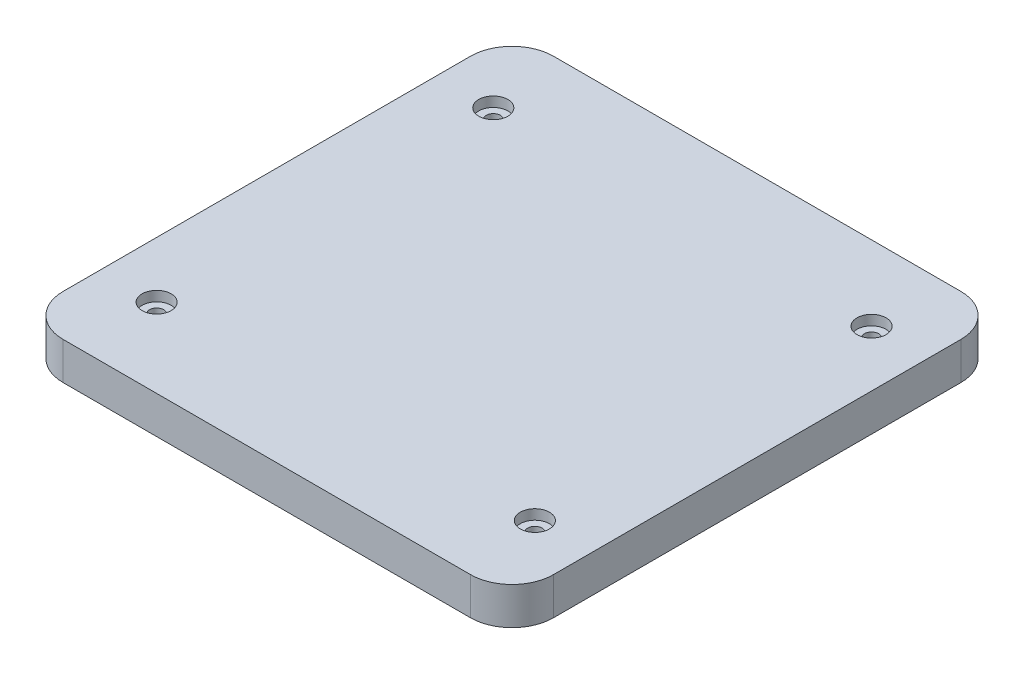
ISO-10303-21;
HEADER;
FILE_DESCRIPTION(('STEP AP214'),'2;1');
FILE_NAME('part.step','',(''),(''),'','','');
FILE_SCHEMA(('AUTOMOTIVE_DESIGN { 1 0 10303 214 1 1 1 1 }'));
ENDSEC;
DATA;
#1=APPLICATION_CONTEXT('core data for automotive mechanical design processes');
#2=APPLICATION_PROTOCOL_DEFINITION('international standard','automotive_design',2000,#1);
#3=PRODUCT_CONTEXT('',#1,'mechanical');
#4=PRODUCT('Part','Part','',(#3));
#5=PRODUCT_RELATED_PRODUCT_CATEGORY('part','',(#4));
#6=PRODUCT_DEFINITION_FORMATION('','',#4);
#7=PRODUCT_DEFINITION_CONTEXT('part definition',#1,'design');
#8=PRODUCT_DEFINITION('design','',#6,#7);
#9=PRODUCT_DEFINITION_SHAPE('','',#8);
#10=(LENGTH_UNIT() NAMED_UNIT(*) SI_UNIT(.MILLI.,.METRE.));
#11=(NAMED_UNIT(*) PLANE_ANGLE_UNIT() SI_UNIT($,.RADIAN.));
#12=(NAMED_UNIT(*) SI_UNIT($,.STERADIAN.) SOLID_ANGLE_UNIT());
#13=UNCERTAINTY_MEASURE_WITH_UNIT(LENGTH_MEASURE(1.E-05),#10,'distance_accuracy_value','');
#14=(GEOMETRIC_REPRESENTATION_CONTEXT(3) GLOBAL_UNCERTAINTY_ASSIGNED_CONTEXT((#13)) GLOBAL_UNIT_ASSIGNED_CONTEXT((#10,
#11,#12)) REPRESENTATION_CONTEXT('',''));
#15=CARTESIAN_POINT('',(0.,0.,0.));
#16=DIRECTION('',(0.,0.,1.));
#17=DIRECTION('',(1.,0.,0.));
#18=AXIS2_PLACEMENT_3D('',#15,#16,#17);
#19=CARTESIAN_POINT('',(-25.9999999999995,339.,159.));
#20=DIRECTION('',(-1.,0.,0.));
#21=DIRECTION('',(0.,0.,1.));
#22=AXIS2_PLACEMENT_3D('',#19,#20,#21);
#23=PLANE('',#22);
#24=DIRECTION('',(0.,0.,-1.));
#25=VECTOR('',#24,1.);
#26=CARTESIAN_POINT('',(-25.9999999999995,330.,159.));
#27=LINE('',#26,#25);
#28=CARTESIAN_POINT('',(-25.9999999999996,330.,149.));
#29=VERTEX_POINT('',#28);
#30=CARTESIAN_POINT('',(-26.0000000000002,330.,50.9999999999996));
#31=VERTEX_POINT('',#30);
#32=EDGE_CURVE('E132',#29,#31,#27,.T.);
#33=ORIENTED_EDGE('',*,*,#32,.T.);
#34=DIRECTION('',(0.,-1.,0.));
#35=VECTOR('',#34,1.);
#36=CARTESIAN_POINT('',(-26.0000000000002,339.,50.9999999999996));
#37=LINE('',#36,#35);
#38=CARTESIAN_POINT('',(-26.0000000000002,339.,50.9999999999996));
#39=VERTEX_POINT('',#38);
#40=EDGE_CURVE('E11',#31,#39,#37,.F.);
#41=ORIENTED_EDGE('',*,*,#40,.T.);
#42=DIRECTION('',(0.,0.,-1.));
#43=VECTOR('',#42,1.);
#44=CARTESIAN_POINT('',(-25.9999999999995,339.,159.));
#45=LINE('',#44,#43);
#46=CARTESIAN_POINT('',(-25.9999999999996,339.,149.));
#47=VERTEX_POINT('',#46);
#48=EDGE_CURVE('E130',#47,#39,#45,.T.);
#49=ORIENTED_EDGE('',*,*,#48,.F.);
#50=DIRECTION('',(0.,-1.,0.));
#51=VECTOR('',#50,1.);
#52=CARTESIAN_POINT('',(-25.9999999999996,339.,149.));
#53=LINE('',#52,#51);
#54=EDGE_CURVE('E43',#47,#29,#53,.T.);
#55=ORIENTED_EDGE('',*,*,#54,.T.);
#56=EDGE_LOOP('',(#33,#41,#49,#55));
#57=FACE_BOUND('',#56,.T.);
#58=ADVANCED_FACE('F34',(#57),#23,.F.);
#59=CARTESIAN_POINT('',(-26.0000000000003,339.,40.9999999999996));
#60=DIRECTION('',(0.,0.,1.));
#61=DIRECTION('',(1.,0.,0.));
#62=AXIS2_PLACEMENT_3D('',#59,#60,#61);
#63=PLANE('',#62);
#64=DIRECTION('',(-1.,0.,0.));
#65=VECTOR('',#64,1.);
#66=CARTESIAN_POINT('',(-26.0000000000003,330.,40.9999999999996));
#67=LINE('',#66,#65);
#68=CARTESIAN_POINT('',(-36.0000000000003,330.,40.9999999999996));
#69=VERTEX_POINT('',#68);
#70=CARTESIAN_POINT('',(-134.,330.,41.0000000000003));
#71=VERTEX_POINT('',#70);
#72=EDGE_CURVE('E128',#69,#71,#67,.T.);
#73=ORIENTED_EDGE('',*,*,#72,.T.);
#74=DIRECTION('',(0.,-1.,0.));
#75=VECTOR('',#74,1.);
#76=CARTESIAN_POINT('',(-134.,339.,41.0000000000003));
#77=LINE('',#76,#75);
#78=CARTESIAN_POINT('',(-134.,339.,41.0000000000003));
#79=VERTEX_POINT('',#78);
#80=EDGE_CURVE('E107',#71,#79,#77,.F.);
#81=ORIENTED_EDGE('',*,*,#80,.T.);
#82=DIRECTION('',(-1.,0.,0.));
#83=VECTOR('',#82,1.);
#84=CARTESIAN_POINT('',(-26.0000000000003,339.,40.9999999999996));
#85=LINE('',#84,#83);
#86=CARTESIAN_POINT('',(-36.0000000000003,339.,40.9999999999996));
#87=VERTEX_POINT('',#86);
#88=EDGE_CURVE('E198',#87,#79,#85,.T.);
#89=ORIENTED_EDGE('',*,*,#88,.F.);
#90=DIRECTION('',(0.,-1.,0.));
#91=VECTOR('',#90,1.);
#92=CARTESIAN_POINT('',(-36.0000000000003,339.,40.9999999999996));
#93=LINE('',#92,#91);
#94=EDGE_CURVE('E112',#87,#69,#93,.T.);
#95=ORIENTED_EDGE('',*,*,#94,.T.);
#96=EDGE_LOOP('',(#73,#81,#89,#95));
#97=FACE_BOUND('',#96,.T.);
#98=ADVANCED_FACE('F215',(#97),#63,.F.);
#99=CARTESIAN_POINT('',(-144.,339.,159.));
#100=DIRECTION('',(1.,0.,0.));
#101=DIRECTION('',(0.,0.,-1.));
#102=AXIS2_PLACEMENT_3D('',#99,#100,#101);
#103=PLANE('',#102);
#104=DIRECTION('',(0.,0.,1.));
#105=VECTOR('',#104,1.);
#106=CARTESIAN_POINT('',(-144.,339.,159.));
#107=LINE('',#106,#105);
#108=CARTESIAN_POINT('',(-144.,339.,51.0000000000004));
#109=VERTEX_POINT('',#108);
#110=CARTESIAN_POINT('',(-144.,339.,149.));
#111=VERTEX_POINT('',#110);
#112=EDGE_CURVE('E121',#109,#111,#107,.T.);
#113=ORIENTED_EDGE('',*,*,#112,.F.);
#114=DIRECTION('',(0.,-1.,0.));
#115=VECTOR('',#114,1.);
#116=CARTESIAN_POINT('',(-144.,339.,51.0000000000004));
#117=LINE('',#116,#115);
#118=CARTESIAN_POINT('',(-144.,330.,51.0000000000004));
#119=VERTEX_POINT('',#118);
#120=EDGE_CURVE('E106',#109,#119,#117,.T.);
#121=ORIENTED_EDGE('',*,*,#120,.T.);
#122=DIRECTION('',(0.,0.,1.));
#123=VECTOR('',#122,1.);
#124=CARTESIAN_POINT('',(-144.,330.,159.));
#125=LINE('',#124,#123);
#126=CARTESIAN_POINT('',(-144.,330.,149.));
#127=VERTEX_POINT('',#126);
#128=EDGE_CURVE('E119',#119,#127,#125,.T.);
#129=ORIENTED_EDGE('',*,*,#128,.T.);
#130=DIRECTION('',(0.,-1.,0.));
#131=VECTOR('',#130,1.);
#132=CARTESIAN_POINT('',(-144.,339.,149.));
#133=LINE('',#132,#131);
#134=EDGE_CURVE('E123',#127,#111,#133,.F.);
#135=ORIENTED_EDGE('',*,*,#134,.T.);
#136=EDGE_LOOP('',(#113,#121,#129,#135));
#137=FACE_BOUND('',#136,.T.);
#138=ADVANCED_FACE('F118',(#137),#103,.F.);
#139=CARTESIAN_POINT('',(-25.9999999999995,339.,159.));
#140=DIRECTION('',(0.,0.,-1.));
#141=DIRECTION('',(-1.,0.,0.));
#142=AXIS2_PLACEMENT_3D('',#139,#140,#141);
#143=PLANE('',#142);
#144=DIRECTION('',(1.,0.,0.));
#145=VECTOR('',#144,1.);
#146=CARTESIAN_POINT('',(-25.9999999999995,339.,159.));
#147=LINE('',#146,#145);
#148=CARTESIAN_POINT('',(-134.,339.,159.));
#149=VERTEX_POINT('',#148);
#150=CARTESIAN_POINT('',(-35.9999999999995,339.,159.));
#151=VERTEX_POINT('',#150);
#152=EDGE_CURVE('E136',#149,#151,#147,.T.);
#153=ORIENTED_EDGE('',*,*,#152,.F.);
#154=DIRECTION('',(0.,-1.,0.));
#155=VECTOR('',#154,1.);
#156=CARTESIAN_POINT('',(-134.,339.,159.));
#157=LINE('',#156,#155);
#158=CARTESIAN_POINT('',(-134.,330.,159.));
#159=VERTEX_POINT('',#158);
#160=EDGE_CURVE('E153',#149,#159,#157,.T.);
#161=ORIENTED_EDGE('',*,*,#160,.T.);
#162=DIRECTION('',(1.,0.,0.));
#163=VECTOR('',#162,1.);
#164=CARTESIAN_POINT('',(-25.9999999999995,330.,159.));
#165=LINE('',#164,#163);
#166=CARTESIAN_POINT('',(-35.9999999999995,330.,159.));
#167=VERTEX_POINT('',#166);
#168=EDGE_CURVE('E127',#159,#167,#165,.T.);
#169=ORIENTED_EDGE('',*,*,#168,.T.);
#170=DIRECTION('',(0.,-1.,0.));
#171=VECTOR('',#170,1.);
#172=CARTESIAN_POINT('',(-35.9999999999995,339.,159.));
#173=LINE('',#172,#171);
#174=EDGE_CURVE('E51',#167,#151,#173,.F.);
#175=ORIENTED_EDGE('',*,*,#174,.T.);
#176=EDGE_LOOP('',(#153,#161,#169,#175));
#177=FACE_BOUND('',#176,.T.);
#178=ADVANCED_FACE('F222',(#177),#143,.F.);
#179=CARTESIAN_POINT('',(-169.999999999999,339.,200.000000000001));
#180=DIRECTION('',(0.,1.,0.));
#181=DIRECTION('',(0.,0.,-1.));
#182=AXIS2_PLACEMENT_3D('',#179,#180,#181);
#183=PLANE('',#182);
#184=CARTESIAN_POINT('',(-39.5000000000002,339.,58.9999999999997));
#185=DIRECTION('',(0.,1.,0.));
#186=DIRECTION('',(0.,0.,-1.));
#187=AXIS2_PLACEMENT_3D('',#184,#185,#186);
#188=CIRCLE('',#187,3.5);
#189=CARTESIAN_POINT('',(-39.5000000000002,339.,55.4999999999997));
#190=VERTEX_POINT('',#189);
#191=EDGE_CURVE('E305',#190,#190,#188,.T.);
#192=ORIENTED_EDGE('',*,*,#191,.F.);
#193=EDGE_LOOP('',(#192));
#194=FACE_BOUND('',#193,.T.);
#195=CARTESIAN_POINT('',(-39.4999999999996,339.,140.));
#196=DIRECTION('',(0.,1.,0.));
#197=DIRECTION('',(0.,0.,-1.));
#198=AXIS2_PLACEMENT_3D('',#195,#196,#197);
#199=CIRCLE('',#198,3.5);
#200=CARTESIAN_POINT('',(-39.4999999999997,339.,136.5));
#201=VERTEX_POINT('',#200);
#202=EDGE_CURVE('E181',#201,#201,#199,.T.);
#203=ORIENTED_EDGE('',*,*,#202,.F.);
#204=EDGE_LOOP('',(#203));
#205=FACE_BOUND('',#204,.T.);
#206=CARTESIAN_POINT('',(-130.5,339.,140.));
#207=DIRECTION('',(0.,1.,0.));
#208=DIRECTION('',(0.,0.,-1.));
#209=AXIS2_PLACEMENT_3D('',#206,#207,#208);
#210=CIRCLE('',#209,3.5);
#211=CARTESIAN_POINT('',(-130.5,339.,136.5));
#212=VERTEX_POINT('',#211);
#213=EDGE_CURVE('E168',#212,#212,#210,.T.);
#214=ORIENTED_EDGE('',*,*,#213,.F.);
#215=EDGE_LOOP('',(#214));
#216=FACE_BOUND('',#215,.T.);
#217=CARTESIAN_POINT('',(-130.5,339.,59.0000000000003));
#218=DIRECTION('',(0.,1.,0.));
#219=DIRECTION('',(0.,0.,-1.));
#220=AXIS2_PLACEMENT_3D('',#217,#218,#219);
#221=CIRCLE('',#220,3.5);
#222=CARTESIAN_POINT('',(-130.5,339.,55.5000000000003));
#223=VERTEX_POINT('',#222);
#224=EDGE_CURVE('E164',#223,#223,#221,.T.);
#225=ORIENTED_EDGE('',*,*,#224,.F.);
#226=EDGE_LOOP('',(#225));
#227=FACE_BOUND('',#226,.T.);
#228=ORIENTED_EDGE('',*,*,#88,.T.);
#229=CARTESIAN_POINT('',(-134.,339.,51.0000000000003));
#230=DIRECTION('',(0.,1.,0.));
#231=DIRECTION('',(0.,0.,-1.));
#232=AXIS2_PLACEMENT_3D('',#229,#230,#231);
#233=CIRCLE('',#232,10.);
#234=EDGE_CURVE('E150',#79,#109,#233,.T.);
#235=ORIENTED_EDGE('',*,*,#234,.T.);
#236=ORIENTED_EDGE('',*,*,#112,.T.);
#237=CARTESIAN_POINT('',(-134.,339.,149.));
#238=DIRECTION('',(0.,1.,0.));
#239=DIRECTION('',(0.,0.,-1.));
#240=AXIS2_PLACEMENT_3D('',#237,#238,#239);
#241=CIRCLE('',#240,10.);
#242=EDGE_CURVE('E58',#111,#149,#241,.T.);
#243=ORIENTED_EDGE('',*,*,#242,.T.);
#244=ORIENTED_EDGE('',*,*,#152,.T.);
#245=CARTESIAN_POINT('',(-35.9999999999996,339.,149.));
#246=DIRECTION('',(0.,1.,0.));
#247=DIRECTION('',(0.,0.,-1.));
#248=AXIS2_PLACEMENT_3D('',#245,#246,#247);
#249=CIRCLE('',#248,10.);
#250=EDGE_CURVE('E145',#151,#47,#249,.T.);
#251=ORIENTED_EDGE('',*,*,#250,.T.);
#252=ORIENTED_EDGE('',*,*,#48,.T.);
#253=CARTESIAN_POINT('',(-36.0000000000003,339.,50.9999999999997));
#254=DIRECTION('',(0.,1.,0.));
#255=DIRECTION('',(0.,0.,-1.));
#256=AXIS2_PLACEMENT_3D('',#253,#254,#255);
#257=CIRCLE('',#256,10.);
#258=EDGE_CURVE('E147',#39,#87,#257,.T.);
#259=ORIENTED_EDGE('',*,*,#258,.T.);
#260=EDGE_LOOP('',(#228,#235,#236,#243,#244,#251,#252,#259));
#261=FACE_BOUND('',#260,.T.);
#262=ADVANCED_FACE('F213',(#194,#205,#216,#227,#261),#183,.T.);
#263=CARTESIAN_POINT('',(-169.999999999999,330.,200.000000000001));
#264=DIRECTION('',(0.,1.,0.));
#265=DIRECTION('',(0.,0.,-1.));
#266=AXIS2_PLACEMENT_3D('',#263,#264,#265);
#267=PLANE('',#266);
#268=CARTESIAN_POINT('',(-39.5000000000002,330.,58.9999999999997));
#269=DIRECTION('',(0.,1.,0.));
#270=DIRECTION('',(0.,0.,-1.));
#271=AXIS2_PLACEMENT_3D('',#268,#269,#270);
#272=CIRCLE('',#271,1.69999999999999);
#273=CARTESIAN_POINT('',(-39.5000000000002,330.,57.2999999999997));
#274=VERTEX_POINT('',#273);
#275=EDGE_CURVE('E38',#274,#274,#272,.T.);
#276=ORIENTED_EDGE('',*,*,#275,.T.);
#277=EDGE_LOOP('',(#276));
#278=FACE_BOUND('',#277,.T.);
#279=CARTESIAN_POINT('',(-39.4999999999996,330.,140.));
#280=DIRECTION('',(0.,1.,0.));
#281=DIRECTION('',(0.,0.,-1.));
#282=AXIS2_PLACEMENT_3D('',#279,#280,#281);
#283=CIRCLE('',#282,1.69999999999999);
#284=CARTESIAN_POINT('',(-39.4999999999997,330.,138.3));
#285=VERTEX_POINT('',#284);
#286=EDGE_CURVE('E166',#285,#285,#283,.T.);
#287=ORIENTED_EDGE('',*,*,#286,.T.);
#288=EDGE_LOOP('',(#287));
#289=FACE_BOUND('',#288,.T.);
#290=CARTESIAN_POINT('',(-130.5,330.,140.));
#291=DIRECTION('',(0.,1.,0.));
#292=DIRECTION('',(0.,0.,-1.));
#293=AXIS2_PLACEMENT_3D('',#290,#291,#292);
#294=CIRCLE('',#293,1.69999999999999);
#295=CARTESIAN_POINT('',(-130.5,330.,138.3));
#296=VERTEX_POINT('',#295);
#297=EDGE_CURVE('E162',#296,#296,#294,.T.);
#298=ORIENTED_EDGE('',*,*,#297,.T.);
#299=EDGE_LOOP('',(#298));
#300=FACE_BOUND('',#299,.T.);
#301=CARTESIAN_POINT('',(-130.5,330.,59.0000000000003));
#302=DIRECTION('',(0.,1.,0.));
#303=DIRECTION('',(0.,0.,-1.));
#304=AXIS2_PLACEMENT_3D('',#301,#302,#303);
#305=CIRCLE('',#304,1.69999999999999);
#306=CARTESIAN_POINT('',(-130.5,330.,57.3000000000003));
#307=VERTEX_POINT('',#306);
#308=EDGE_CURVE('E158',#307,#307,#305,.T.);
#309=ORIENTED_EDGE('',*,*,#308,.T.);
#310=EDGE_LOOP('',(#309));
#311=FACE_BOUND('',#310,.T.);
#312=ORIENTED_EDGE('',*,*,#128,.F.);
#313=CARTESIAN_POINT('',(-134.,330.,51.0000000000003));
#314=DIRECTION('',(0.,1.,0.));
#315=DIRECTION('',(0.,0.,-1.));
#316=AXIS2_PLACEMENT_3D('',#313,#314,#315);
#317=CIRCLE('',#316,10.);
#318=EDGE_CURVE('E102',#119,#71,#317,.F.);
#319=ORIENTED_EDGE('',*,*,#318,.T.);
#320=ORIENTED_EDGE('',*,*,#72,.F.);
#321=CARTESIAN_POINT('',(-36.0000000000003,330.,50.9999999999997));
#322=DIRECTION('',(0.,1.,0.));
#323=DIRECTION('',(0.,0.,-1.));
#324=AXIS2_PLACEMENT_3D('',#321,#322,#323);
#325=CIRCLE('',#324,10.);
#326=EDGE_CURVE('E139',#69,#31,#325,.F.);
#327=ORIENTED_EDGE('',*,*,#326,.T.);
#328=ORIENTED_EDGE('',*,*,#32,.F.);
#329=CARTESIAN_POINT('',(-35.9999999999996,330.,149.));
#330=DIRECTION('',(0.,1.,0.));
#331=DIRECTION('',(0.,0.,-1.));
#332=AXIS2_PLACEMENT_3D('',#329,#330,#331);
#333=CIRCLE('',#332,10.);
#334=EDGE_CURVE('E122',#29,#167,#333,.F.);
#335=ORIENTED_EDGE('',*,*,#334,.T.);
#336=ORIENTED_EDGE('',*,*,#168,.F.);
#337=CARTESIAN_POINT('',(-134.,330.,149.));
#338=DIRECTION('',(0.,1.,0.));
#339=DIRECTION('',(0.,0.,-1.));
#340=AXIS2_PLACEMENT_3D('',#337,#338,#339);
#341=CIRCLE('',#340,10.);
#342=EDGE_CURVE('E113',#159,#127,#341,.F.);
#343=ORIENTED_EDGE('',*,*,#342,.T.);
#344=EDGE_LOOP('',(#312,#319,#320,#327,#328,#335,#336,#343));
#345=FACE_BOUND('',#344,.T.);
#346=ADVANCED_FACE('F125',(#278,#289,#300,#311,#345),#267,.F.);
#347=CARTESIAN_POINT('',(-134.,339.,51.0000000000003));
#348=DIRECTION('',(0.,-1.,0.));
#349=DIRECTION('',(0.,0.,1.));
#350=AXIS2_PLACEMENT_3D('',#347,#348,#349);
#351=CYLINDRICAL_SURFACE('',#350,10.);
#352=ORIENTED_EDGE('',*,*,#234,.F.);
#353=ORIENTED_EDGE('',*,*,#80,.F.);
#354=ORIENTED_EDGE('',*,*,#318,.F.);
#355=ORIENTED_EDGE('',*,*,#120,.F.);
#356=EDGE_LOOP('',(#352,#353,#354,#355));
#357=FACE_BOUND('',#356,.T.);
#358=ADVANCED_FACE('F105',(#357),#351,.T.);
#359=CARTESIAN_POINT('',(-134.,339.,149.));
#360=DIRECTION('',(0.,-1.,0.));
#361=DIRECTION('',(0.,0.,1.));
#362=AXIS2_PLACEMENT_3D('',#359,#360,#361);
#363=CYLINDRICAL_SURFACE('',#362,10.);
#364=ORIENTED_EDGE('',*,*,#242,.F.);
#365=ORIENTED_EDGE('',*,*,#134,.F.);
#366=ORIENTED_EDGE('',*,*,#342,.F.);
#367=ORIENTED_EDGE('',*,*,#160,.F.);
#368=EDGE_LOOP('',(#364,#365,#366,#367));
#369=FACE_BOUND('',#368,.T.);
#370=ADVANCED_FACE('F229',(#369),#363,.T.);
#371=CARTESIAN_POINT('',(-36.0000000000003,339.,50.9999999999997));
#372=DIRECTION('',(0.,-1.,0.));
#373=DIRECTION('',(0.,0.,1.));
#374=AXIS2_PLACEMENT_3D('',#371,#372,#373);
#375=CYLINDRICAL_SURFACE('',#374,10.);
#376=ORIENTED_EDGE('',*,*,#258,.F.);
#377=ORIENTED_EDGE('',*,*,#40,.F.);
#378=ORIENTED_EDGE('',*,*,#326,.F.);
#379=ORIENTED_EDGE('',*,*,#94,.F.);
#380=EDGE_LOOP('',(#376,#377,#378,#379));
#381=FACE_BOUND('',#380,.T.);
#382=ADVANCED_FACE('F210',(#381),#375,.T.);
#383=CARTESIAN_POINT('',(-35.9999999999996,339.,149.));
#384=DIRECTION('',(0.,-1.,0.));
#385=DIRECTION('',(0.,0.,1.));
#386=AXIS2_PLACEMENT_3D('',#383,#384,#385);
#387=CYLINDRICAL_SURFACE('',#386,10.);
#388=ORIENTED_EDGE('',*,*,#250,.F.);
#389=ORIENTED_EDGE('',*,*,#174,.F.);
#390=ORIENTED_EDGE('',*,*,#334,.F.);
#391=ORIENTED_EDGE('',*,*,#54,.F.);
#392=EDGE_LOOP('',(#388,#389,#390,#391));
#393=FACE_BOUND('',#392,.T.);
#394=ADVANCED_FACE('F36',(#393),#387,.T.);
#395=CARTESIAN_POINT('',(-130.5,339.,59.0000000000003));
#396=DIRECTION('',(0.,1.,0.));
#397=DIRECTION('',(0.,0.,-1.));
#398=AXIS2_PLACEMENT_3D('',#395,#396,#397);
#399=CYLINDRICAL_SURFACE('',#398,1.69999999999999);
#400=CARTESIAN_POINT('',(-130.5,336.6,59.0000000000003));
#401=DIRECTION('',(0.,1.,0.));
#402=DIRECTION('',(0.,0.,-1.));
#403=AXIS2_PLACEMENT_3D('',#400,#401,#402);
#404=CIRCLE('',#403,1.69999999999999);
#405=CARTESIAN_POINT('',(-130.5,336.6,57.3000000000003));
#406=VERTEX_POINT('',#405);
#407=EDGE_CURVE('E161',#406,#406,#404,.T.);
#408=ORIENTED_EDGE('',*,*,#407,.T.);
#409=EDGE_LOOP('',(#408));
#410=FACE_BOUND('',#409,.T.);
#411=ORIENTED_EDGE('',*,*,#308,.F.);
#412=EDGE_LOOP('',(#411));
#413=FACE_BOUND('',#412,.T.);
#414=ADVANCED_FACE('F236',(#410,#413),#399,.F.);
#415=CARTESIAN_POINT('',(-132.2,336.6,59.0000000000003));
#416=DIRECTION('',(0.,-1.,0.));
#417=DIRECTION('',(0.,0.,1.));
#418=AXIS2_PLACEMENT_3D('',#415,#416,#417);
#419=PLANE('',#418);
#420=ORIENTED_EDGE('',*,*,#407,.F.);
#421=EDGE_LOOP('',(#420));
#422=FACE_BOUND('',#421,.T.);
#423=CARTESIAN_POINT('',(-130.5,336.6,59.0000000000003));
#424=DIRECTION('',(0.,1.,0.));
#425=DIRECTION('',(0.,0.,-1.));
#426=AXIS2_PLACEMENT_3D('',#423,#424,#425);
#427=CIRCLE('',#426,3.5);
#428=CARTESIAN_POINT('',(-130.5,336.6,55.5000000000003));
#429=VERTEX_POINT('',#428);
#430=EDGE_CURVE('E191',#429,#429,#427,.T.);
#431=ORIENTED_EDGE('',*,*,#430,.T.);
#432=EDGE_LOOP('',(#431));
#433=FACE_BOUND('',#432,.T.);
#434=ADVANCED_FACE('F241',(#422,#433),#419,.F.);
#435=CARTESIAN_POINT('',(-130.5,339.,59.0000000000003));
#436=DIRECTION('',(0.,1.,0.));
#437=DIRECTION('',(0.,0.,-1.));
#438=AXIS2_PLACEMENT_3D('',#435,#436,#437);
#439=CYLINDRICAL_SURFACE('',#438,3.5);
#440=ORIENTED_EDGE('',*,*,#430,.F.);
#441=EDGE_LOOP('',(#440));
#442=FACE_BOUND('',#441,.T.);
#443=ORIENTED_EDGE('',*,*,#224,.T.);
#444=EDGE_LOOP('',(#443));
#445=FACE_BOUND('',#444,.T.);
#446=ADVANCED_FACE('F258',(#442,#445),#439,.F.);
#447=CARTESIAN_POINT('',(-130.5,339.,140.));
#448=DIRECTION('',(0.,1.,0.));
#449=DIRECTION('',(0.,0.,-1.));
#450=AXIS2_PLACEMENT_3D('',#447,#448,#449);
#451=CYLINDRICAL_SURFACE('',#450,1.69999999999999);
#452=CARTESIAN_POINT('',(-130.5,336.6,140.));
#453=DIRECTION('',(0.,1.,0.));
#454=DIRECTION('',(0.,0.,-1.));
#455=AXIS2_PLACEMENT_3D('',#452,#453,#454);
#456=CIRCLE('',#455,1.69999999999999);
#457=CARTESIAN_POINT('',(-130.5,336.6,138.3));
#458=VERTEX_POINT('',#457);
#459=EDGE_CURVE('E165',#458,#458,#456,.T.);
#460=ORIENTED_EDGE('',*,*,#459,.T.);
#461=EDGE_LOOP('',(#460));
#462=FACE_BOUND('',#461,.T.);
#463=ORIENTED_EDGE('',*,*,#297,.F.);
#464=EDGE_LOOP('',(#463));
#465=FACE_BOUND('',#464,.T.);
#466=ADVANCED_FACE('F262',(#462,#465),#451,.F.);
#467=CARTESIAN_POINT('',(-132.2,336.6,140.));
#468=DIRECTION('',(0.,-1.,0.));
#469=DIRECTION('',(0.,0.,1.));
#470=AXIS2_PLACEMENT_3D('',#467,#468,#469);
#471=PLANE('',#470);
#472=ORIENTED_EDGE('',*,*,#459,.F.);
#473=EDGE_LOOP('',(#472));
#474=FACE_BOUND('',#473,.T.);
#475=CARTESIAN_POINT('',(-130.5,336.6,140.));
#476=DIRECTION('',(0.,1.,0.));
#477=DIRECTION('',(0.,0.,-1.));
#478=AXIS2_PLACEMENT_3D('',#475,#476,#477);
#479=CIRCLE('',#478,3.5);
#480=CARTESIAN_POINT('',(-130.5,336.6,136.5));
#481=VERTEX_POINT('',#480);
#482=EDGE_CURVE('E173',#481,#481,#479,.T.);
#483=ORIENTED_EDGE('',*,*,#482,.T.);
#484=EDGE_LOOP('',(#483));
#485=FACE_BOUND('',#484,.T.);
#486=ADVANCED_FACE('F266',(#474,#485),#471,.F.);
#487=CARTESIAN_POINT('',(-130.5,339.,140.));
#488=DIRECTION('',(0.,1.,0.));
#489=DIRECTION('',(0.,0.,-1.));
#490=AXIS2_PLACEMENT_3D('',#487,#488,#489);
#491=CYLINDRICAL_SURFACE('',#490,3.5);
#492=ORIENTED_EDGE('',*,*,#482,.F.);
#493=EDGE_LOOP('',(#492));
#494=FACE_BOUND('',#493,.T.);
#495=ORIENTED_EDGE('',*,*,#213,.T.);
#496=EDGE_LOOP('',(#495));
#497=FACE_BOUND('',#496,.T.);
#498=ADVANCED_FACE('F270',(#494,#497),#491,.F.);
#499=CARTESIAN_POINT('',(-39.4999999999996,339.,140.));
#500=DIRECTION('',(0.,1.,0.));
#501=DIRECTION('',(0.,0.,-1.));
#502=AXIS2_PLACEMENT_3D('',#499,#500,#501);
#503=CYLINDRICAL_SURFACE('',#502,1.69999999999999);
#504=CARTESIAN_POINT('',(-39.4999999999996,336.6,140.));
#505=DIRECTION('',(0.,1.,0.));
#506=DIRECTION('',(0.,0.,-1.));
#507=AXIS2_PLACEMENT_3D('',#504,#505,#506);
#508=CIRCLE('',#507,1.70000000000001);
#509=CARTESIAN_POINT('',(-39.4999999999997,336.6,138.3));
#510=VERTEX_POINT('',#509);
#511=EDGE_CURVE('E169',#510,#510,#508,.T.);
#512=ORIENTED_EDGE('',*,*,#511,.T.);
#513=EDGE_LOOP('',(#512));
#514=FACE_BOUND('',#513,.T.);
#515=ORIENTED_EDGE('',*,*,#286,.F.);
#516=EDGE_LOOP('',(#515));
#517=FACE_BOUND('',#516,.T.);
#518=ADVANCED_FACE('F274',(#514,#517),#503,.F.);
#519=CARTESIAN_POINT('',(-41.1999999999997,336.6,140.));
#520=DIRECTION('',(0.,-1.,0.));
#521=DIRECTION('',(0.,0.,1.));
#522=AXIS2_PLACEMENT_3D('',#519,#520,#521);
#523=PLANE('',#522);
#524=ORIENTED_EDGE('',*,*,#511,.F.);
#525=EDGE_LOOP('',(#524));
#526=FACE_BOUND('',#525,.T.);
#527=CARTESIAN_POINT('',(-39.4999999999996,336.6,140.));
#528=DIRECTION('',(0.,1.,0.));
#529=DIRECTION('',(0.,0.,-1.));
#530=AXIS2_PLACEMENT_3D('',#527,#528,#529);
#531=CIRCLE('',#530,3.5);
#532=CARTESIAN_POINT('',(-39.4999999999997,336.6,136.5));
#533=VERTEX_POINT('',#532);
#534=EDGE_CURVE('E176',#533,#533,#531,.T.);
#535=ORIENTED_EDGE('',*,*,#534,.T.);
#536=EDGE_LOOP('',(#535));
#537=FACE_BOUND('',#536,.T.);
#538=ADVANCED_FACE('F278',(#526,#537),#523,.F.);
#539=CARTESIAN_POINT('',(-39.4999999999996,339.,140.));
#540=DIRECTION('',(0.,1.,0.));
#541=DIRECTION('',(0.,0.,-1.));
#542=AXIS2_PLACEMENT_3D('',#539,#540,#541);
#543=CYLINDRICAL_SURFACE('',#542,3.5);
#544=ORIENTED_EDGE('',*,*,#534,.F.);
#545=EDGE_LOOP('',(#544));
#546=FACE_BOUND('',#545,.T.);
#547=ORIENTED_EDGE('',*,*,#202,.T.);
#548=EDGE_LOOP('',(#547));
#549=FACE_BOUND('',#548,.T.);
#550=ADVANCED_FACE('F281',(#546,#549),#543,.F.);
#551=CARTESIAN_POINT('',(-39.5000000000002,339.,58.9999999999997));
#552=DIRECTION('',(0.,1.,0.));
#553=DIRECTION('',(0.,0.,-1.));
#554=AXIS2_PLACEMENT_3D('',#551,#552,#553);
#555=CYLINDRICAL_SURFACE('',#554,1.69999999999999);
#556=CARTESIAN_POINT('',(-39.5000000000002,336.6,58.9999999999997));
#557=DIRECTION('',(0.,1.,0.));
#558=DIRECTION('',(0.,0.,-1.));
#559=AXIS2_PLACEMENT_3D('',#556,#557,#558);
#560=CIRCLE('',#559,1.70000000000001);
#561=CARTESIAN_POINT('',(-39.5000000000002,336.6,57.2999999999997));
#562=VERTEX_POINT('',#561);
#563=EDGE_CURVE('E307',#562,#562,#560,.T.);
#564=ORIENTED_EDGE('',*,*,#563,.T.);
#565=EDGE_LOOP('',(#564));
#566=FACE_BOUND('',#565,.T.);
#567=ORIENTED_EDGE('',*,*,#275,.F.);
#568=EDGE_LOOP('',(#567));
#569=FACE_BOUND('',#568,.T.);
#570=ADVANCED_FACE('F285',(#566,#569),#555,.F.);
#571=CARTESIAN_POINT('',(-41.2000000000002,336.6,58.9999999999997));
#572=DIRECTION('',(0.,-1.,0.));
#573=DIRECTION('',(0.,0.,1.));
#574=AXIS2_PLACEMENT_3D('',#571,#572,#573);
#575=PLANE('',#574);
#576=ORIENTED_EDGE('',*,*,#563,.F.);
#577=EDGE_LOOP('',(#576));
#578=FACE_BOUND('',#577,.T.);
#579=CARTESIAN_POINT('',(-39.5000000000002,336.6,58.9999999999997));
#580=DIRECTION('',(0.,1.,0.));
#581=DIRECTION('',(0.,0.,-1.));
#582=AXIS2_PLACEMENT_3D('',#579,#580,#581);
#583=CIRCLE('',#582,3.5);
#584=CARTESIAN_POINT('',(-39.5000000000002,336.6,55.4999999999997));
#585=VERTEX_POINT('',#584);
#586=EDGE_CURVE('E302',#585,#585,#583,.T.);
#587=ORIENTED_EDGE('',*,*,#586,.T.);
#588=EDGE_LOOP('',(#587));
#589=FACE_BOUND('',#588,.T.);
#590=ADVANCED_FACE('F289',(#578,#589),#575,.F.);
#591=CARTESIAN_POINT('',(-39.5000000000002,339.,58.9999999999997));
#592=DIRECTION('',(0.,1.,0.));
#593=DIRECTION('',(0.,0.,-1.));
#594=AXIS2_PLACEMENT_3D('',#591,#592,#593);
#595=CYLINDRICAL_SURFACE('',#594,3.5);
#596=ORIENTED_EDGE('',*,*,#586,.F.);
#597=EDGE_LOOP('',(#596));
#598=FACE_BOUND('',#597,.T.);
#599=ORIENTED_EDGE('',*,*,#191,.T.);
#600=EDGE_LOOP('',(#599));
#601=FACE_BOUND('',#600,.T.);
#602=ADVANCED_FACE('F293',(#598,#601),#595,.F.);
#603=CLOSED_SHELL('',(#58,#98,#138,#178,#262,#346,#358,#370,#382,#394,#414,#434,#446,#466,#486,
#498,#518,#538,#550,#570,#590,#602));
#604=MANIFOLD_SOLID_BREP('B2',#603);
#605=ADVANCED_BREP_SHAPE_REPRESENTATION('',(#18,#604),#14);
#606=SHAPE_DEFINITION_REPRESENTATION(#9,#605);
ENDSEC;
END-ISO-10303-21;
